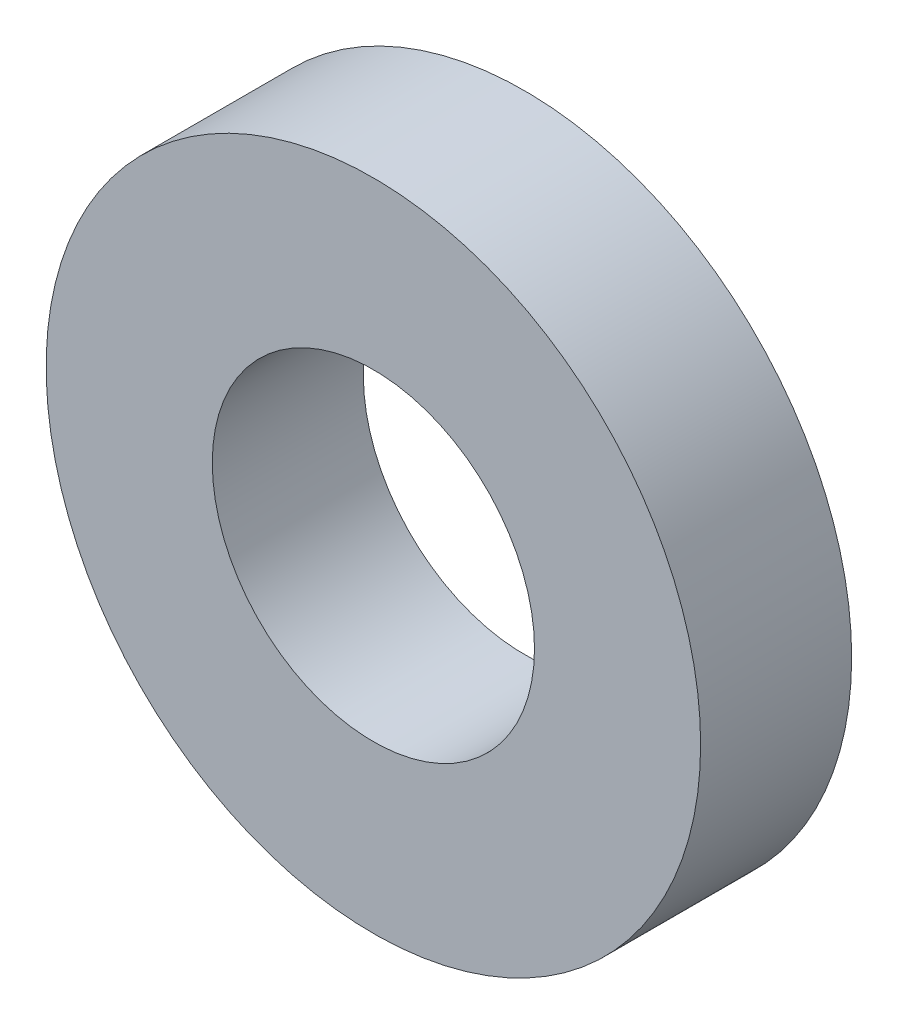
ISO-10303-21;
HEADER;
FILE_DESCRIPTION(('STEP AP214'),'2;1');
FILE_NAME('part.step','',(''),(''),'','','');
FILE_SCHEMA(('AUTOMOTIVE_DESIGN { 1 0 10303 214 1 1 1 1 }'));
ENDSEC;
DATA;
#1=APPLICATION_CONTEXT('core data for automotive mechanical design processes');
#2=APPLICATION_PROTOCOL_DEFINITION('international standard','automotive_design',2000,#1);
#3=PRODUCT_CONTEXT('',#1,'mechanical');
#4=PRODUCT('Part','Part','',(#3));
#5=PRODUCT_RELATED_PRODUCT_CATEGORY('part','',(#4));
#6=PRODUCT_DEFINITION_FORMATION('','',#4);
#7=PRODUCT_DEFINITION_CONTEXT('part definition',#1,'design');
#8=PRODUCT_DEFINITION('design','',#6,#7);
#9=PRODUCT_DEFINITION_SHAPE('','',#8);
#10=(LENGTH_UNIT() NAMED_UNIT(*) SI_UNIT(.MILLI.,.METRE.));
#11=(NAMED_UNIT(*) PLANE_ANGLE_UNIT() SI_UNIT($,.RADIAN.));
#12=(NAMED_UNIT(*) SI_UNIT($,.STERADIAN.) SOLID_ANGLE_UNIT());
#13=UNCERTAINTY_MEASURE_WITH_UNIT(LENGTH_MEASURE(1.E-05),#10,'distance_accuracy_value','');
#14=(GEOMETRIC_REPRESENTATION_CONTEXT(3) GLOBAL_UNCERTAINTY_ASSIGNED_CONTEXT((#13)) GLOBAL_UNIT_ASSIGNED_CONTEXT((#10,
#11,#12)) REPRESENTATION_CONTEXT('',''));
#15=CARTESIAN_POINT('',(0.,0.,0.));
#16=DIRECTION('',(0.,0.,1.));
#17=DIRECTION('',(1.,0.,0.));
#18=AXIS2_PLACEMENT_3D('',#15,#16,#17);
#19=CARTESIAN_POINT('',(0.,0.,3.));
#20=DIRECTION('',(0.,0.,1.));
#21=DIRECTION('',(1.,0.,0.));
#22=AXIS2_PLACEMENT_3D('',#19,#20,#21);
#23=PLANE('',#22);
#24=CARTESIAN_POINT('',(0.,0.,3.));
#25=DIRECTION('',(0.,0.,1.));
#26=DIRECTION('',(1.,0.,0.));
#27=AXIS2_PLACEMENT_3D('',#24,#25,#26);
#28=CIRCLE('',#27,6.5);
#29=CARTESIAN_POINT('',(6.5,0.,3.));
#30=VERTEX_POINT('',#29);
#31=EDGE_CURVE('E8',#30,#30,#28,.T.);
#32=ORIENTED_EDGE('',*,*,#31,.T.);
#33=EDGE_LOOP('',(#32));
#34=FACE_BOUND('',#33,.T.);
#35=CARTESIAN_POINT('',(0.,0.,3.));
#36=DIRECTION('',(0.,0.,1.));
#37=DIRECTION('',(1.,0.,0.));
#38=AXIS2_PLACEMENT_3D('',#35,#36,#37);
#39=CIRCLE('',#38,3.2);
#40=CARTESIAN_POINT('',(3.2,0.,3.));
#41=VERTEX_POINT('',#40);
#42=EDGE_CURVE('E23',#41,#41,#39,.T.);
#43=ORIENTED_EDGE('',*,*,#42,.F.);
#44=EDGE_LOOP('',(#43));
#45=FACE_BOUND('',#44,.T.);
#46=ADVANCED_FACE('F12',(#34,#45),#23,.T.);
#47=CARTESIAN_POINT('',(0.,0.,0.));
#48=DIRECTION('',(0.,0.,1.));
#49=DIRECTION('',(1.,0.,0.));
#50=AXIS2_PLACEMENT_3D('',#47,#48,#49);
#51=PLANE('',#50);
#52=CARTESIAN_POINT('',(0.,0.,0.));
#53=DIRECTION('',(0.,0.,1.));
#54=DIRECTION('',(1.,0.,0.));
#55=AXIS2_PLACEMENT_3D('',#52,#53,#54);
#56=CIRCLE('',#55,6.5);
#57=CARTESIAN_POINT('',(6.5,0.,0.));
#58=VERTEX_POINT('',#57);
#59=EDGE_CURVE('E19',#58,#58,#56,.T.);
#60=ORIENTED_EDGE('',*,*,#59,.F.);
#61=EDGE_LOOP('',(#60));
#62=FACE_BOUND('',#61,.T.);
#63=CARTESIAN_POINT('',(0.,0.,0.));
#64=DIRECTION('',(0.,0.,1.));
#65=DIRECTION('',(1.,0.,0.));
#66=AXIS2_PLACEMENT_3D('',#63,#64,#65);
#67=CIRCLE('',#66,3.2);
#68=CARTESIAN_POINT('',(3.2,0.,0.));
#69=VERTEX_POINT('',#68);
#70=EDGE_CURVE('E27',#69,#69,#67,.T.);
#71=ORIENTED_EDGE('',*,*,#70,.T.);
#72=EDGE_LOOP('',(#71));
#73=FACE_BOUND('',#72,.T.);
#74=ADVANCED_FACE('F33',(#62,#73),#51,.F.);
#75=CARTESIAN_POINT('',(0.,0.,3.));
#76=DIRECTION('',(0.,0.,-1.));
#77=DIRECTION('',(-1.,0.,0.));
#78=AXIS2_PLACEMENT_3D('',#75,#76,#77);
#79=CYLINDRICAL_SURFACE('',#78,6.5);
#80=ORIENTED_EDGE('',*,*,#31,.F.);
#81=EDGE_LOOP('',(#80));
#82=FACE_BOUND('',#81,.T.);
#83=ORIENTED_EDGE('',*,*,#59,.T.);
#84=EDGE_LOOP('',(#83));
#85=FACE_BOUND('',#84,.T.);
#86=ADVANCED_FACE('F14',(#82,#85),#79,.T.);
#87=CARTESIAN_POINT('',(0.,0.,3.));
#88=DIRECTION('',(0.,0.,-1.));
#89=DIRECTION('',(-1.,0.,0.));
#90=AXIS2_PLACEMENT_3D('',#87,#88,#89);
#91=CYLINDRICAL_SURFACE('',#90,3.2);
#92=ORIENTED_EDGE('',*,*,#42,.T.);
#93=EDGE_LOOP('',(#92));
#94=FACE_BOUND('',#93,.T.);
#95=ORIENTED_EDGE('',*,*,#70,.F.);
#96=EDGE_LOOP('',(#95));
#97=FACE_BOUND('',#96,.T.);
#98=ADVANCED_FACE('F35',(#94,#97),#91,.F.);
#99=CLOSED_SHELL('',(#46,#74,#86,#98));
#100=MANIFOLD_SOLID_BREP('B1',#99);
#101=ADVANCED_BREP_SHAPE_REPRESENTATION('',(#18,#100),#14);
#102=SHAPE_DEFINITION_REPRESENTATION(#9,#101);
ENDSEC;
END-ISO-10303-21;
